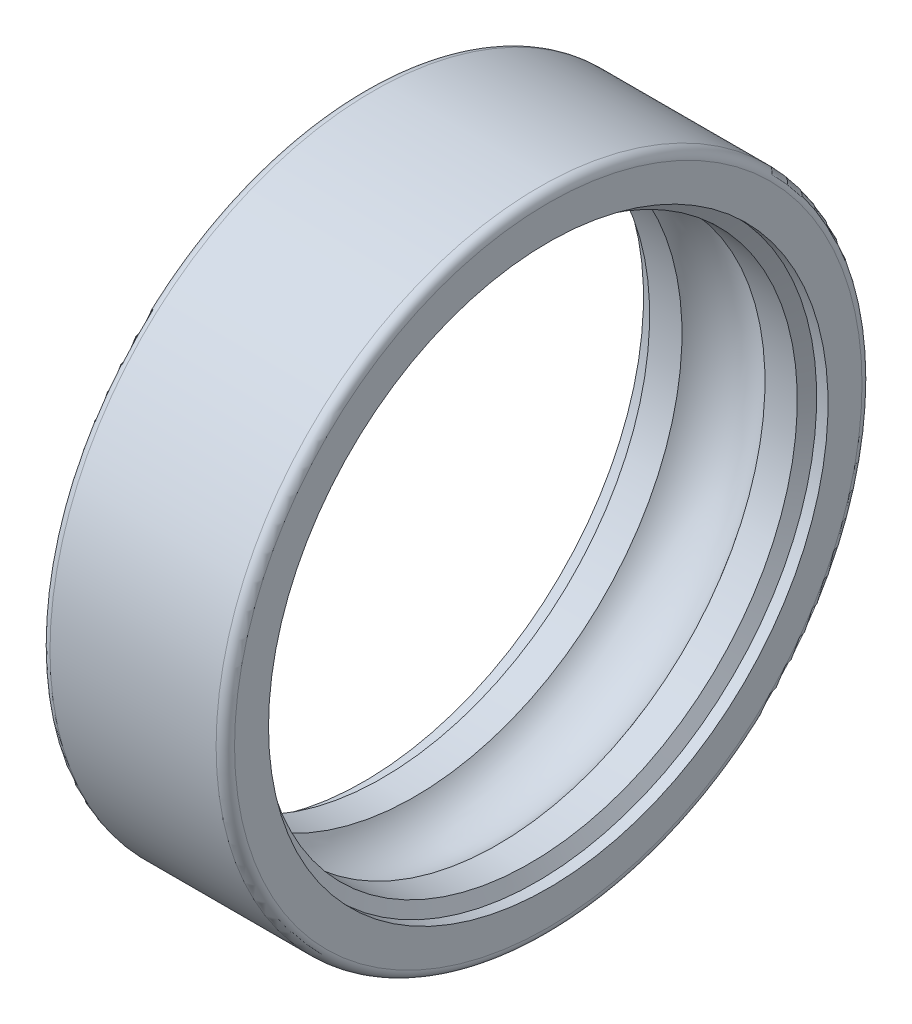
ISO-10303-21;
HEADER;
FILE_DESCRIPTION(('STEP AP214'),'2;1');
FILE_NAME('part.step','',(''),(''),'','','');
FILE_SCHEMA(('AUTOMOTIVE_DESIGN { 1 0 10303 214 1 1 1 1 }'));
ENDSEC;
DATA;
#1=APPLICATION_CONTEXT('core data for automotive mechanical design processes');
#2=APPLICATION_PROTOCOL_DEFINITION('international standard','automotive_design',2000,#1);
#3=PRODUCT_CONTEXT('',#1,'mechanical');
#4=PRODUCT('Part','Part','',(#3));
#5=PRODUCT_RELATED_PRODUCT_CATEGORY('part','',(#4));
#6=PRODUCT_DEFINITION_FORMATION('','',#4);
#7=PRODUCT_DEFINITION_CONTEXT('part definition',#1,'design');
#8=PRODUCT_DEFINITION('design','',#6,#7);
#9=PRODUCT_DEFINITION_SHAPE('','',#8);
#10=(LENGTH_UNIT() NAMED_UNIT(*) SI_UNIT(.MILLI.,.METRE.));
#11=(NAMED_UNIT(*) PLANE_ANGLE_UNIT() SI_UNIT($,.RADIAN.));
#12=(NAMED_UNIT(*) SI_UNIT($,.STERADIAN.) SOLID_ANGLE_UNIT());
#13=UNCERTAINTY_MEASURE_WITH_UNIT(LENGTH_MEASURE(1.E-05),#10,'distance_accuracy_value','');
#14=(GEOMETRIC_REPRESENTATION_CONTEXT(3) GLOBAL_UNCERTAINTY_ASSIGNED_CONTEXT((#13)) GLOBAL_UNIT_ASSIGNED_CONTEXT((#10,
#11,#12)) REPRESENTATION_CONTEXT('',''));
#15=CARTESIAN_POINT('',(0.,0.,0.));
#16=DIRECTION('',(0.,0.,1.));
#17=DIRECTION('',(1.,0.,0.));
#18=AXIS2_PLACEMENT_3D('',#15,#16,#17);
#19=CARTESIAN_POINT('',(0.500000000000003,0.,0.));
#20=DIRECTION('',(-1.,0.,0.));
#21=DIRECTION('',(0.,0.,1.));
#22=AXIS2_PLACEMENT_3D('',#19,#20,#21);
#23=TOROIDAL_SURFACE('',#22,17.,0.500000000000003);
#24=CARTESIAN_POINT('',(0.,0.,0.));
#25=DIRECTION('',(-1.,0.,0.));
#26=DIRECTION('',(0.,0.,1.));
#27=AXIS2_PLACEMENT_3D('',#24,#25,#26);
#28=CIRCLE('',#27,17.);
#29=CARTESIAN_POINT('',(0.,0.,17.));
#30=VERTEX_POINT('',#29);
#31=EDGE_CURVE('E10',#30,#30,#28,.T.);
#32=ORIENTED_EDGE('',*,*,#31,.F.);
#33=EDGE_LOOP('',(#32));
#34=FACE_BOUND('',#33,.T.);
#35=CARTESIAN_POINT('',(0.5,0.,0.));
#36=DIRECTION('',(-1.,0.,0.));
#37=DIRECTION('',(0.,0.,1.));
#38=AXIS2_PLACEMENT_3D('',#35,#36,#37);
#39=CIRCLE('',#38,17.5);
#40=CARTESIAN_POINT('',(0.5,0.,17.5));
#41=VERTEX_POINT('',#40);
#42=EDGE_CURVE('E75',#41,#41,#39,.T.);
#43=ORIENTED_EDGE('',*,*,#42,.T.);
#44=EDGE_LOOP('',(#43));
#45=FACE_BOUND('',#44,.T.);
#46=ADVANCED_FACE('F35',(#34,#45),#23,.T.);
#47=CARTESIAN_POINT('',(0.,17.,0.));
#48=DIRECTION('',(1.,0.,0.));
#49=DIRECTION('',(0.,0.,-1.));
#50=AXIS2_PLACEMENT_3D('',#47,#48,#49);
#51=PLANE('',#50);
#52=CARTESIAN_POINT('',(0.,0.,0.));
#53=DIRECTION('',(-1.,0.,0.));
#54=DIRECTION('',(0.,0.,1.));
#55=AXIS2_PLACEMENT_3D('',#52,#53,#54);
#56=CIRCLE('',#55,15.16);
#57=CARTESIAN_POINT('',(0.,0.,15.16));
#58=VERTEX_POINT('',#57);
#59=EDGE_CURVE('E41',#58,#58,#56,.T.);
#60=ORIENTED_EDGE('',*,*,#59,.F.);
#61=EDGE_LOOP('',(#60));
#62=FACE_BOUND('',#61,.T.);
#63=ORIENTED_EDGE('',*,*,#31,.T.);
#64=EDGE_LOOP('',(#63));
#65=FACE_BOUND('',#64,.T.);
#66=ADVANCED_FACE('F136',(#62,#65),#51,.F.);
#67=CARTESIAN_POINT('',(10.,0.,0.));
#68=DIRECTION('',(-1.,0.,0.));
#69=DIRECTION('',(0.,0.,1.));
#70=AXIS2_PLACEMENT_3D('',#67,#68,#69);
#71=CYLINDRICAL_SURFACE('',#70,15.16);
#72=CARTESIAN_POINT('',(0.615484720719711,0.,0.));
#73=DIRECTION('',(-1.,0.,0.));
#74=DIRECTION('',(0.,0.,1.));
#75=AXIS2_PLACEMENT_3D('',#72,#73,#74);
#76=CIRCLE('',#75,15.16);
#77=CARTESIAN_POINT('',(0.615484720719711,0.,15.16));
#78=VERTEX_POINT('',#77);
#79=EDGE_CURVE('E45',#78,#78,#76,.T.);
#80=ORIENTED_EDGE('',*,*,#79,.F.);
#81=EDGE_LOOP('',(#80));
#82=FACE_BOUND('',#81,.T.);
#83=ORIENTED_EDGE('',*,*,#59,.T.);
#84=EDGE_LOOP('',(#83));
#85=FACE_BOUND('',#84,.T.);
#86=ADVANCED_FACE('F131',(#82,#85),#71,.F.);
#87=CARTESIAN_POINT('',(0.615484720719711,0.,0.));
#88=DIRECTION('',(-1.,0.,0.));
#89=DIRECTION('',(0.,0.,1.));
#90=AXIS2_PLACEMENT_3D('',#87,#88,#89);
#91=CONICAL_SURFACE('',#90,15.16,1.0471975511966);
#92=CARTESIAN_POINT('',(1.,0.,0.));
#93=DIRECTION('',(-1.,0.,0.));
#94=DIRECTION('',(0.,0.,1.));
#95=AXIS2_PLACEMENT_3D('',#92,#93,#94);
#96=CIRCLE('',#95,14.494);
#97=CARTESIAN_POINT('',(1.,0.,14.494));
#98=VERTEX_POINT('',#97);
#99=EDGE_CURVE('E49',#98,#98,#96,.T.);
#100=ORIENTED_EDGE('',*,*,#99,.F.);
#101=EDGE_LOOP('',(#100));
#102=FACE_BOUND('',#101,.T.);
#103=ORIENTED_EDGE('',*,*,#79,.T.);
#104=EDGE_LOOP('',(#103));
#105=FACE_BOUND('',#104,.T.);
#106=ADVANCED_FACE('F125',(#102,#105),#91,.F.);
#107=CARTESIAN_POINT('',(10.,0.,0.));
#108=DIRECTION('',(-1.,0.,0.));
#109=DIRECTION('',(0.,0.,1.));
#110=AXIS2_PLACEMENT_3D('',#107,#108,#109);
#111=CYLINDRICAL_SURFACE('',#110,14.494);
#112=CARTESIAN_POINT('',(2.75100822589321,0.,0.));
#113=DIRECTION('',(-1.,0.,0.));
#114=DIRECTION('',(0.,0.,1.));
#115=AXIS2_PLACEMENT_3D('',#112,#113,#114);
#116=CIRCLE('',#115,14.494);
#117=CARTESIAN_POINT('',(2.75100822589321,0.,14.494));
#118=VERTEX_POINT('',#117);
#119=EDGE_CURVE('E54',#118,#118,#116,.T.);
#120=ORIENTED_EDGE('',*,*,#119,.F.);
#121=EDGE_LOOP('',(#120));
#122=FACE_BOUND('',#121,.T.);
#123=ORIENTED_EDGE('',*,*,#99,.T.);
#124=EDGE_LOOP('',(#123));
#125=FACE_BOUND('',#124,.T.);
#126=ADVANCED_FACE('F119',(#122,#125),#111,.F.);
#127=CARTESIAN_POINT('',(5.,0.,0.));
#128=DIRECTION('',(-1.,0.,0.));
#129=DIRECTION('',(0.,0.,1.));
#130=AXIS2_PLACEMENT_3D('',#127,#128,#129);
#131=TOROIDAL_SURFACE('',#130,13.,2.7);
#132=CARTESIAN_POINT('',(7.24899177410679,0.,0.));
#133=DIRECTION('',(-1.,0.,0.));
#134=DIRECTION('',(0.,0.,1.));
#135=AXIS2_PLACEMENT_3D('',#132,#133,#134);
#136=CIRCLE('',#135,14.494);
#137=CARTESIAN_POINT('',(7.24899177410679,0.,14.494));
#138=VERTEX_POINT('',#137);
#139=EDGE_CURVE('E57',#138,#138,#136,.T.);
#140=ORIENTED_EDGE('',*,*,#139,.F.);
#141=EDGE_LOOP('',(#140));
#142=FACE_BOUND('',#141,.T.);
#143=ORIENTED_EDGE('',*,*,#119,.T.);
#144=EDGE_LOOP('',(#143));
#145=FACE_BOUND('',#144,.T.);
#146=ADVANCED_FACE('F113',(#142,#145),#131,.F.);
#147=CARTESIAN_POINT('',(10.,0.,0.));
#148=DIRECTION('',(-1.,0.,0.));
#149=DIRECTION('',(0.,0.,1.));
#150=AXIS2_PLACEMENT_3D('',#147,#148,#149);
#151=CYLINDRICAL_SURFACE('',#150,14.494);
#152=CARTESIAN_POINT('',(9.,0.,0.));
#153=DIRECTION('',(-1.,0.,0.));
#154=DIRECTION('',(0.,0.,1.));
#155=AXIS2_PLACEMENT_3D('',#152,#153,#154);
#156=CIRCLE('',#155,14.494);
#157=CARTESIAN_POINT('',(9.,0.,14.494));
#158=VERTEX_POINT('',#157);
#159=EDGE_CURVE('E60',#158,#158,#156,.T.);
#160=ORIENTED_EDGE('',*,*,#159,.F.);
#161=EDGE_LOOP('',(#160));
#162=FACE_BOUND('',#161,.T.);
#163=ORIENTED_EDGE('',*,*,#139,.T.);
#164=EDGE_LOOP('',(#163));
#165=FACE_BOUND('',#164,.T.);
#166=ADVANCED_FACE('F107',(#162,#165),#151,.F.);
#167=CARTESIAN_POINT('',(9.,0.,0.));
#168=DIRECTION('',(1.,0.,0.));
#169=DIRECTION('',(0.,0.,-1.));
#170=AXIS2_PLACEMENT_3D('',#167,#168,#169);
#171=CONICAL_SURFACE('',#170,14.494,1.0471975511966);
#172=CARTESIAN_POINT('',(9.38451527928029,0.,0.));
#173=DIRECTION('',(-1.,0.,0.));
#174=DIRECTION('',(0.,0.,1.));
#175=AXIS2_PLACEMENT_3D('',#172,#173,#174);
#176=CIRCLE('',#175,15.16);
#177=CARTESIAN_POINT('',(9.38451527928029,0.,15.16));
#178=VERTEX_POINT('',#177);
#179=EDGE_CURVE('E63',#178,#178,#176,.T.);
#180=ORIENTED_EDGE('',*,*,#179,.F.);
#181=EDGE_LOOP('',(#180));
#182=FACE_BOUND('',#181,.T.);
#183=ORIENTED_EDGE('',*,*,#159,.T.);
#184=EDGE_LOOP('',(#183));
#185=FACE_BOUND('',#184,.T.);
#186=ADVANCED_FACE('F101',(#182,#185),#171,.F.);
#187=CARTESIAN_POINT('',(10.,0.,0.));
#188=DIRECTION('',(-1.,0.,0.));
#189=DIRECTION('',(0.,0.,1.));
#190=AXIS2_PLACEMENT_3D('',#187,#188,#189);
#191=CYLINDRICAL_SURFACE('',#190,15.16);
#192=CARTESIAN_POINT('',(10.,0.,0.));
#193=DIRECTION('',(-1.,0.,0.));
#194=DIRECTION('',(0.,0.,1.));
#195=AXIS2_PLACEMENT_3D('',#192,#193,#194);
#196=CIRCLE('',#195,15.16);
#197=CARTESIAN_POINT('',(10.,0.,15.16));
#198=VERTEX_POINT('',#197);
#199=EDGE_CURVE('E66',#198,#198,#196,.T.);
#200=ORIENTED_EDGE('',*,*,#199,.F.);
#201=EDGE_LOOP('',(#200));
#202=FACE_BOUND('',#201,.T.);
#203=ORIENTED_EDGE('',*,*,#179,.T.);
#204=EDGE_LOOP('',(#203));
#205=FACE_BOUND('',#204,.T.);
#206=ADVANCED_FACE('F95',(#202,#205),#191,.F.);
#207=CARTESIAN_POINT('',(10.,15.16,0.));
#208=DIRECTION('',(-1.,0.,0.));
#209=DIRECTION('',(0.,0.,1.));
#210=AXIS2_PLACEMENT_3D('',#207,#208,#209);
#211=PLANE('',#210);
#212=CARTESIAN_POINT('',(10.,0.,0.));
#213=DIRECTION('',(-1.,0.,0.));
#214=DIRECTION('',(0.,0.,1.));
#215=AXIS2_PLACEMENT_3D('',#212,#213,#214);
#216=CIRCLE('',#215,17.);
#217=CARTESIAN_POINT('',(10.,0.,17.));
#218=VERTEX_POINT('',#217);
#219=EDGE_CURVE('E69',#218,#218,#216,.T.);
#220=ORIENTED_EDGE('',*,*,#219,.F.);
#221=EDGE_LOOP('',(#220));
#222=FACE_BOUND('',#221,.T.);
#223=ORIENTED_EDGE('',*,*,#199,.T.);
#224=EDGE_LOOP('',(#223));
#225=FACE_BOUND('',#224,.T.);
#226=ADVANCED_FACE('F89',(#222,#225),#211,.F.);
#227=CARTESIAN_POINT('',(9.5,0.,0.));
#228=DIRECTION('',(-1.,0.,0.));
#229=DIRECTION('',(0.,0.,1.));
#230=AXIS2_PLACEMENT_3D('',#227,#228,#229);
#231=TOROIDAL_SURFACE('',#230,17.,0.500000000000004);
#232=CARTESIAN_POINT('',(9.5,0.,0.));
#233=DIRECTION('',(-1.,0.,0.));
#234=DIRECTION('',(0.,0.,1.));
#235=AXIS2_PLACEMENT_3D('',#232,#233,#234);
#236=CIRCLE('',#235,17.5);
#237=CARTESIAN_POINT('',(9.5,0.,17.5));
#238=VERTEX_POINT('',#237);
#239=EDGE_CURVE('E72',#238,#238,#236,.T.);
#240=ORIENTED_EDGE('',*,*,#239,.F.);
#241=EDGE_LOOP('',(#240));
#242=FACE_BOUND('',#241,.T.);
#243=ORIENTED_EDGE('',*,*,#219,.T.);
#244=EDGE_LOOP('',(#243));
#245=FACE_BOUND('',#244,.T.);
#246=ADVANCED_FACE('F83',(#242,#245),#231,.T.);
#247=CARTESIAN_POINT('',(10.,0.,0.));
#248=DIRECTION('',(-1.,0.,0.));
#249=DIRECTION('',(0.,0.,1.));
#250=AXIS2_PLACEMENT_3D('',#247,#248,#249);
#251=CYLINDRICAL_SURFACE('',#250,17.5);
#252=ORIENTED_EDGE('',*,*,#42,.F.);
#253=EDGE_LOOP('',(#252));
#254=FACE_BOUND('',#253,.T.);
#255=ORIENTED_EDGE('',*,*,#239,.T.);
#256=EDGE_LOOP('',(#255));
#257=FACE_BOUND('',#256,.T.);
#258=ADVANCED_FACE('F80',(#254,#257),#251,.T.);
#259=CLOSED_SHELL('',(#46,#66,#86,#106,#126,#146,#166,#186,#206,#226,#246,#258));
#260=MANIFOLD_SOLID_BREP('B2',#259);
#261=ADVANCED_BREP_SHAPE_REPRESENTATION('',(#18,#260),#14);
#262=SHAPE_DEFINITION_REPRESENTATION(#9,#261);
ENDSEC;
END-ISO-10303-21;
